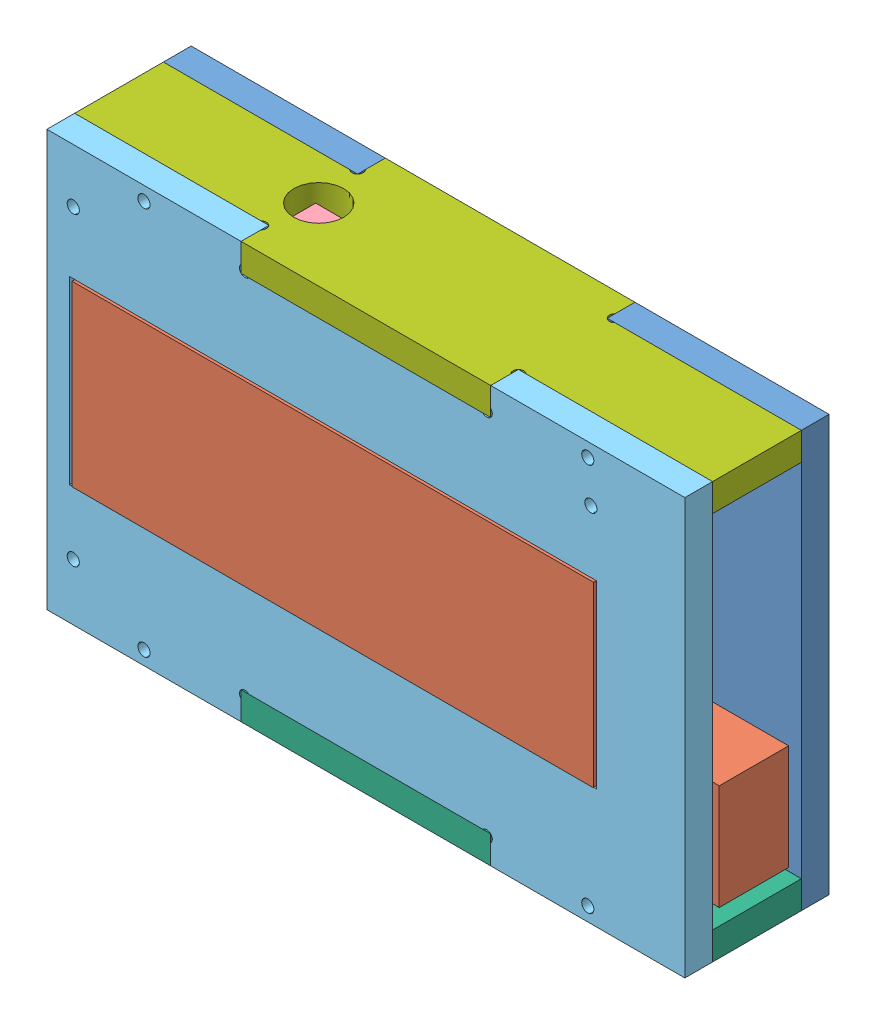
SolidWorks assembly assemblage socle OLED 4 lignes.SLDASM, configuration Défaut (file format 7000). Lengths in mm.
Overall size (115 75 26).
10 component instances, 7 part files, 25 mates.
Components (placement in the parent):
- support OLED 4 lignes-1: support OLED 4 lignes.SLDPRT [Défaut] at origin size (115 75 5)
- ecran OLED 4 lignes-1: ecran OLED 4 lignes.SLDPRT [Défaut] at (2.5 7.5 19.4) size (112.1 60 19.1)
- entretoise D6x4-1: entretoise D6x4.SLDPRT [Défaut] at (12.5 43.5 5) size (6 6 4)
- entretoise D6x4-2: entretoise D6x4.SLDPRT [Défaut] at (12.5 65.5 5) size (6 6 4)
- entretoise D6x4-3: entretoise D6x4.SLDPRT [Défaut] at (59 65.5 5) size (6 6 4)
- entretoise D6x4-4: entretoise D6x4.SLDPRT [Défaut] at (59 43.5 5) size (6 6 4)
- KAP MOLEDK-1: KAP MOLEDK.SLDPRT [Défaut] at (63 69.5 9) x (-1 0 0) z (0 0 1) size (54.5 36 6.8)
- cache OLED 4 lignes-1: cache OLED 4 lignes.SLDPRT [Défaut] at (0 0 21) size (115 75 5)
- plaque infirieur-1: plaque infirieur.SLDPRT [Défaut] at (0 5 0) x (1 0 0) z (0 -1 0) size (115 26 5)
- plaque superieur-1: plaque superieur.SLDPRT [Défaut] at (0 70 26) x (1 0 0) z (0 1 0) size (115 26 5)
Mates (geometry in assembly coordinates):
- Coaxiale6: concentric aligned: cylinder of support OLED 4 lignes-1 through (12.5 65.5 -0.001) axis (0 0 1) radius 1.1; cylinder of entretoise D6x4-2 through (12.5 65.5 4.999) axis (0 0 1) radius 1.5
- Coïncidente5: coincident anti-aligned: plane of support OLED 4 lignes-1 through (0 75 5) normal (0 0 1); plane of entretoise D6x4-2 through (12.5 65.5 5) normal (0 0 -1)
- Coïncidente7: coincident anti-aligned: plane of support OLED 4 lignes-1 through (0 75 5) normal (0 0 1); plane of entretoise D6x4-3 through (59 65.5 5) normal (0 0 -1)
- Coaxiale10: concentric aligned: cylinder of support OLED 4 lignes-1 through (59 65.5 -0.001) axis (0 0 1) radius 1.1; cylinder of entretoise D6x4-3 through (59 65.5 4.999) axis (0 0 1) radius 1.5
- Coaxiale11: concentric aligned: cylinder of support OLED 4 lignes-1 through (59 43.5 -0.001) axis (0 0 1) radius 1.1; cylinder of entretoise D6x4-4 through (59 43.5 4.999) axis (0 0 1) radius 1.5
- Coïncidente8: coincident anti-aligned: plane of support OLED 4 lignes-1 through (0 75 5) normal (0 0 1); plane of entretoise D6x4-4 through (59 43.5 5) normal (0 0 -1)
- Coaxiale12: concentric aligned: cylinder of support OLED 4 lignes-1 through (12.5 43.5 -0.001) axis (0 0 1) radius 1.1; cylinder of entretoise D6x4-1 through (12.5 43.5 4.999) axis (0 0 1) radius 1.5
- Coïncidente9: coincident anti-aligned: plane of support OLED 4 lignes-1 through (0 75 5) normal (0 0 1); plane of entretoise D6x4-1 through (12.5 43.5 5) normal (0 0 -1)
- Coaxiale17: concentric anti-aligned: cylinder of ecran OLED 4 lignes-1 through (4.75 65.25 26.001) axis (0 0 -1) radius 1.25; cylinder of cache OLED 4 lignes-1 through (4.75 65.25 20.999) axis (0 0 1) radius 1.1
- Coaxiale18: concentric anti-aligned: cylinder of ecran OLED 4 lignes-1 through (98.05 65.25 26.001) axis (0 0 -1) radius 1.25; cylinder of cache OLED 4 lignes-1 through (98.05 65.25 20.999) axis (0 0 1) radius 1.1
- Coïncidente13: coincident anti-aligned: plane of entretoise D6x4-3 through (59 65.5 9) normal (0 0 1); plane of KAP MOLEDK-1 through (63 39.5 9) normal (0 0 -1)
- Coaxiale19: concentric aligned: cylinder of entretoise D6x4-3 through (59 65.5 4.999) axis (0 0 1) radius 1.5; cylinder of KAP MOLEDK-1 through (59 65.5 8.999) axis (0 0 1) radius 1.6
- Coaxiale20: concentric aligned: cylinder of entretoise D6x4-2 through (12.5 65.5 4.999) axis (0 0 1) radius 1.5; cylinder of KAP MOLEDK-1 through (12.5 65.5 8.999) axis (0 0 1) radius 1.6
- Coïncidente18: coincident anti-aligned: plane of support OLED 4 lignes-1 through (80 5 5.001) normal (0 -1 0); plane of plaque infirieur-1 through (0 5 26) normal (0 1 0)
- Coïncidente19: coincident anti-aligned: plane of support OLED 4 lignes-1 through (80 0 5.001) normal (-1 0 0); plane of plaque infirieur-1 through (80 5.001 0) normal (1 0 0)
- Coïncidente20: coincident anti-aligned: plane of support OLED 4 lignes-1 through (0 75 5) normal (0 0 1); plane of plaque infirieur-1 through (115 5.001 5) normal (0 0 -1)
- Coïncidente21: coincident anti-aligned: plane of cache OLED 4 lignes-1 through (80 0 20.999) normal (-1 0 0); plane of plaque infirieur-1 through (80 5.001 26) normal (1 0 0)
- Coïncidente22: coincident anti-aligned: plane of cache OLED 4 lignes-1 through (0 75 21) normal (0 0 -1); plane of plaque infirieur-1 through (115 5.001 21) normal (0 0 1)
- Coïncidente23: coincident anti-aligned: plane of cache OLED 4 lignes-1 through (80 5 20.999) normal (0 -1 0); plane of plaque infirieur-1 through (0 5 26) normal (0 1 0)
- Coïncidente24: coincident anti-aligned: plane of support OLED 4 lignes-1 through (80 70 5.001) normal (0 1 0); plane of plaque superieur-1 through (0 70 0) normal (0 -1 0)
- Coïncidente25: coincident anti-aligned: plane of cache OLED 4 lignes-1 through (35 70 20.999) normal (0 1 0); plane of plaque superieur-1 through (0 70 0) normal (0 -1 0)
- Coïncidente26: coincident anti-aligned: plane of support OLED 4 lignes-1 through (80 75 5.001) normal (-1 0 0); plane of plaque superieur-1 through (80 69.999 0) normal (1 0 0)
- Coïncidente27: coincident anti-aligned: plane of cache OLED 4 lignes-1 through (80 75 20.999) normal (-1 0 0); plane of plaque superieur-1 through (80 69.999 26) normal (1 0 0)
- Coïncidente28: coincident anti-aligned: plane of support OLED 4 lignes-1 through (0 75 5) normal (0 0 1); plane of plaque superieur-1 through (115 69.999 5) normal (0 0 -1)
- Coïncidente29: coincident anti-aligned: plane of ecran OLED 4 lignes-1 through (2.5 67.5 21) normal (0 0 1); plane of cache OLED 4 lignes-1 through (0 75 21) normal (0 0 -1)
